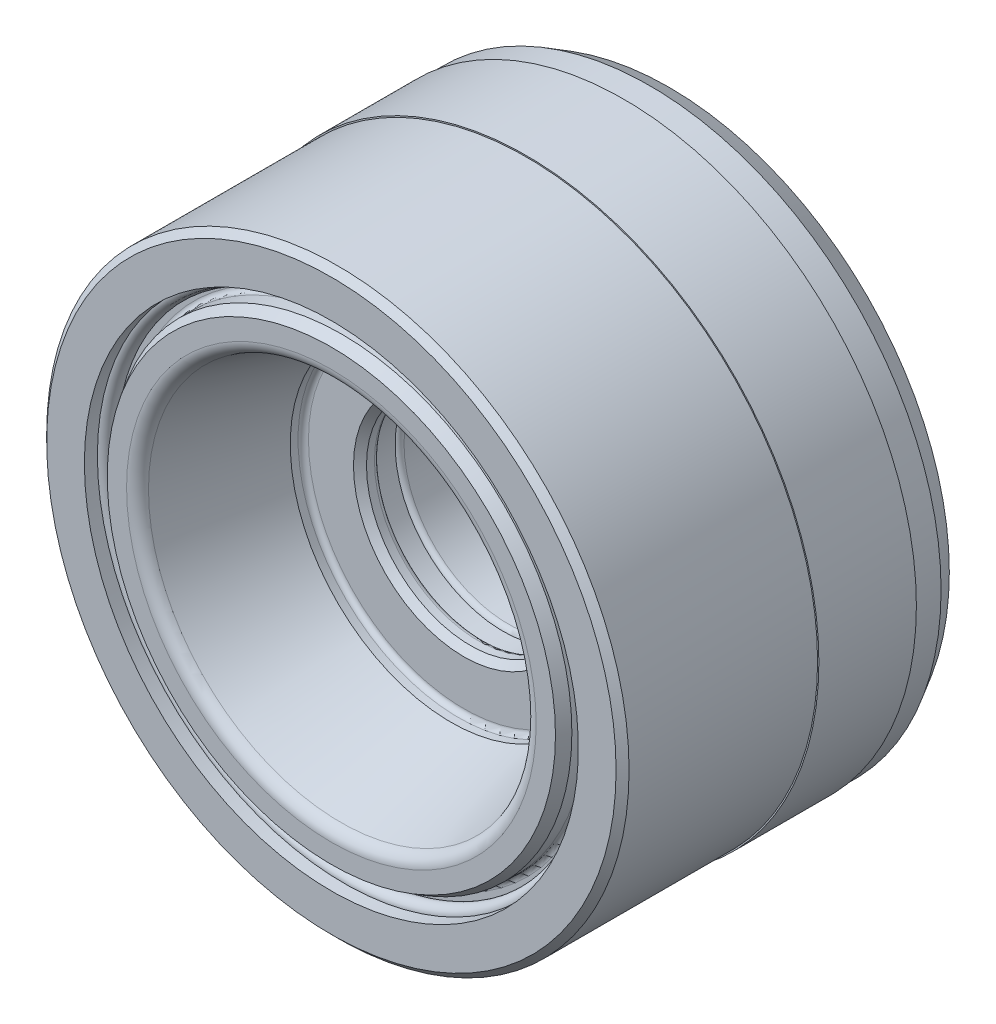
ISO-10303-21;
HEADER;
FILE_DESCRIPTION(('STEP AP214'),'2;1');
FILE_NAME('part.step','',(''),(''),'','','');
FILE_SCHEMA(('AUTOMOTIVE_DESIGN { 1 0 10303 214 1 1 1 1 }'));
ENDSEC;
DATA;
#1=APPLICATION_CONTEXT('core data for automotive mechanical design processes');
#2=APPLICATION_PROTOCOL_DEFINITION('international standard','automotive_design',2000,#1);
#3=PRODUCT_CONTEXT('',#1,'mechanical');
#4=PRODUCT('Part','Part','',(#3));
#5=PRODUCT_RELATED_PRODUCT_CATEGORY('part','',(#4));
#6=PRODUCT_DEFINITION_FORMATION('','',#4);
#7=PRODUCT_DEFINITION_CONTEXT('part definition',#1,'design');
#8=PRODUCT_DEFINITION('design','',#6,#7);
#9=PRODUCT_DEFINITION_SHAPE('','',#8);
#10=(LENGTH_UNIT() NAMED_UNIT(*) SI_UNIT(.MILLI.,.METRE.));
#11=(NAMED_UNIT(*) PLANE_ANGLE_UNIT() SI_UNIT($,.RADIAN.));
#12=(NAMED_UNIT(*) SI_UNIT($,.STERADIAN.) SOLID_ANGLE_UNIT());
#13=UNCERTAINTY_MEASURE_WITH_UNIT(LENGTH_MEASURE(1.E-05),#10,'distance_accuracy_value','');
#14=(GEOMETRIC_REPRESENTATION_CONTEXT(3) GLOBAL_UNCERTAINTY_ASSIGNED_CONTEXT((#13)) GLOBAL_UNIT_ASSIGNED_CONTEXT((#10,
#11,#12)) REPRESENTATION_CONTEXT('',''));
#15=CARTESIAN_POINT('',(0.,0.,0.));
#16=DIRECTION('',(0.,0.,1.));
#17=DIRECTION('',(1.,0.,0.));
#18=AXIS2_PLACEMENT_3D('',#15,#16,#17);
#19=CARTESIAN_POINT('',(0.,0.,0.));
#20=DIRECTION('',(0.,0.,-1.));
#21=DIRECTION('',(-1.,0.,0.));
#22=AXIS2_PLACEMENT_3D('',#19,#20,#21);
#23=CYLINDRICAL_SURFACE('',#22,19.);
#24=CARTESIAN_POINT('',(0.,0.,0.));
#25=DIRECTION('',(0.,0.,-1.));
#26=DIRECTION('',(-1.,0.,0.));
#27=AXIS2_PLACEMENT_3D('',#24,#25,#26);
#28=CIRCLE('',#27,19.);
#29=CARTESIAN_POINT('',(-19.,0.,0.));
#30=VERTEX_POINT('',#29);
#31=EDGE_CURVE('E42',#30,#30,#28,.T.);
#32=ORIENTED_EDGE('',*,*,#31,.F.);
#33=EDGE_LOOP('',(#32));
#34=FACE_BOUND('',#33,.T.);
#35=CARTESIAN_POINT('',(0.,0.,-1.));
#36=DIRECTION('',(0.,0.,-1.));
#37=DIRECTION('',(-1.,0.,0.));
#38=AXIS2_PLACEMENT_3D('',#35,#36,#37);
#39=CIRCLE('',#38,19.);
#40=CARTESIAN_POINT('',(-19.,0.,-1.));
#41=VERTEX_POINT('',#40);
#42=EDGE_CURVE('E81',#41,#41,#39,.F.);
#43=ORIENTED_EDGE('',*,*,#42,.F.);
#44=EDGE_LOOP('',(#43));
#45=FACE_BOUND('',#44,.T.);
#46=ADVANCED_FACE('F12',(#34,#45),#23,.F.);
#47=CARTESIAN_POINT('',(-22.5,0.,0.));
#48=DIRECTION('',(0.,0.,1.));
#49=DIRECTION('',(1.,0.,0.));
#50=AXIS2_PLACEMENT_3D('',#47,#48,#49);
#51=PLANE('',#50);
#52=CARTESIAN_POINT('',(0.,0.,0.));
#53=DIRECTION('',(0.,0.,1.));
#54=DIRECTION('',(1.,0.,0.));
#55=AXIS2_PLACEMENT_3D('',#52,#53,#54);
#56=CIRCLE('',#55,21.9);
#57=CARTESIAN_POINT('',(21.9,0.,0.));
#58=VERTEX_POINT('',#57);
#59=EDGE_CURVE('E54',#58,#58,#56,.T.);
#60=ORIENTED_EDGE('',*,*,#59,.T.);
#61=EDGE_LOOP('',(#60));
#62=FACE_BOUND('',#61,.T.);
#63=ORIENTED_EDGE('',*,*,#31,.T.);
#64=EDGE_LOOP('',(#63));
#65=FACE_BOUND('',#64,.T.);
#66=ADVANCED_FACE('F233',(#62,#65),#51,.T.);
#67=CARTESIAN_POINT('',(0.,0.,-0.499999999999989));
#68=DIRECTION('',(0.,0.,-1.));
#69=DIRECTION('',(-1.,0.,0.));
#70=AXIS2_PLACEMENT_3D('',#67,#68,#69);
#71=CONICAL_SURFACE('',#70,22.4,0.785398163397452);
#72=ORIENTED_EDGE('',*,*,#59,.F.);
#73=EDGE_LOOP('',(#72));
#74=FACE_BOUND('',#73,.T.);
#75=CARTESIAN_POINT('',(0.,0.,-0.499999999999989));
#76=DIRECTION('',(0.,0.,1.));
#77=DIRECTION('',(1.,0.,0.));
#78=AXIS2_PLACEMENT_3D('',#75,#76,#77);
#79=CIRCLE('',#78,22.4);
#80=CARTESIAN_POINT('',(22.4,0.,-0.499999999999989));
#81=VERTEX_POINT('',#80);
#82=EDGE_CURVE('E51',#81,#81,#79,.F.);
#83=ORIENTED_EDGE('',*,*,#82,.F.);
#84=EDGE_LOOP('',(#83));
#85=FACE_BOUND('',#84,.T.);
#86=ADVANCED_FACE('F191',(#74,#85),#71,.T.);
#87=CARTESIAN_POINT('',(0.,0.,0.));
#88=DIRECTION('',(0.,0.,-1.));
#89=DIRECTION('',(-1.,0.,0.));
#90=AXIS2_PLACEMENT_3D('',#87,#88,#89);
#91=CYLINDRICAL_SURFACE('',#90,22.4);
#92=ORIENTED_EDGE('',*,*,#82,.T.);
#93=EDGE_LOOP('',(#92));
#94=FACE_BOUND('',#93,.T.);
#95=CARTESIAN_POINT('',(0.,0.,-15.));
#96=DIRECTION('',(0.,0.,-1.));
#97=DIRECTION('',(-1.,0.,0.));
#98=AXIS2_PLACEMENT_3D('',#95,#96,#97);
#99=CIRCLE('',#98,22.4);
#100=CARTESIAN_POINT('',(-22.4,0.,-15.));
#101=VERTEX_POINT('',#100);
#102=EDGE_CURVE('E29',#101,#101,#99,.T.);
#103=ORIENTED_EDGE('',*,*,#102,.F.);
#104=EDGE_LOOP('',(#103));
#105=FACE_BOUND('',#104,.T.);
#106=ADVANCED_FACE('F186',(#94,#105),#91,.T.);
#107=CARTESIAN_POINT('',(-22.5,0.,-15.));
#108=DIRECTION('',(0.,0.,-1.));
#109=DIRECTION('',(-1.,0.,0.));
#110=AXIS2_PLACEMENT_3D('',#107,#108,#109);
#111=PLANE('',#110);
#112=CARTESIAN_POINT('',(0.,0.,-15.));
#113=DIRECTION('',(0.,0.,-1.));
#114=DIRECTION('',(-1.,0.,0.));
#115=AXIS2_PLACEMENT_3D('',#112,#113,#114);
#116=CIRCLE('',#115,22.5);
#117=CARTESIAN_POINT('',(-22.5,0.,-15.));
#118=VERTEX_POINT('',#117);
#119=EDGE_CURVE('E32',#118,#118,#116,.T.);
#120=ORIENTED_EDGE('',*,*,#119,.F.);
#121=EDGE_LOOP('',(#120));
#122=FACE_BOUND('',#121,.T.);
#123=ORIENTED_EDGE('',*,*,#102,.T.);
#124=EDGE_LOOP('',(#123));
#125=FACE_BOUND('',#124,.T.);
#126=ADVANCED_FACE('F242',(#122,#125),#111,.F.);
#127=CARTESIAN_POINT('',(0.,0.,0.));
#128=DIRECTION('',(0.,0.,-1.));
#129=DIRECTION('',(-1.,0.,0.));
#130=AXIS2_PLACEMENT_3D('',#127,#128,#129);
#131=CYLINDRICAL_SURFACE('',#130,22.5);
#132=ORIENTED_EDGE('',*,*,#119,.T.);
#133=EDGE_LOOP('',(#132));
#134=FACE_BOUND('',#133,.T.);
#135=CARTESIAN_POINT('',(0.,0.,-22.5));
#136=DIRECTION('',(0.,0.,-1.));
#137=DIRECTION('',(-1.,0.,0.));
#138=AXIS2_PLACEMENT_3D('',#135,#136,#137);
#139=CIRCLE('',#138,22.5);
#140=CARTESIAN_POINT('',(-22.5,0.,-22.5));
#141=VERTEX_POINT('',#140);
#142=EDGE_CURVE('E39',#141,#141,#139,.T.);
#143=ORIENTED_EDGE('',*,*,#142,.F.);
#144=EDGE_LOOP('',(#143));
#145=FACE_BOUND('',#144,.T.);
#146=ADVANCED_FACE('F220',(#134,#145),#131,.T.);
#147=CARTESIAN_POINT('',(-22.5,0.,-22.5));
#148=DIRECTION('',(0.,0.,1.));
#149=DIRECTION('',(1.,0.,0.));
#150=AXIS2_PLACEMENT_3D('',#147,#148,#149);
#151=PLANE('',#150);
#152=CARTESIAN_POINT('',(0.,0.,-22.5));
#153=DIRECTION('',(0.,0.,-1.));
#154=DIRECTION('',(-1.,0.,0.));
#155=AXIS2_PLACEMENT_3D('',#152,#153,#154);
#156=CIRCLE('',#155,22.4);
#157=CARTESIAN_POINT('',(-22.4,0.,-22.5));
#158=VERTEX_POINT('',#157);
#159=EDGE_CURVE('E36',#158,#158,#156,.T.);
#160=ORIENTED_EDGE('',*,*,#159,.F.);
#161=EDGE_LOOP('',(#160));
#162=FACE_BOUND('',#161,.T.);
#163=ORIENTED_EDGE('',*,*,#142,.T.);
#164=EDGE_LOOP('',(#163));
#165=FACE_BOUND('',#164,.T.);
#166=ADVANCED_FACE('F241',(#162,#165),#151,.F.);
#167=CARTESIAN_POINT('',(0.,0.,0.));
#168=DIRECTION('',(0.,0.,-1.));
#169=DIRECTION('',(-1.,0.,0.));
#170=AXIS2_PLACEMENT_3D('',#167,#168,#169);
#171=CYLINDRICAL_SURFACE('',#170,22.4);
#172=CARTESIAN_POINT('',(0.,0.,-24.5));
#173=DIRECTION('',(0.,0.,-1.));
#174=DIRECTION('',(-1.,0.,0.));
#175=AXIS2_PLACEMENT_3D('',#172,#173,#174);
#176=CIRCLE('',#175,22.4);
#177=CARTESIAN_POINT('',(-22.4,0.,-24.5));
#178=VERTEX_POINT('',#177);
#179=EDGE_CURVE('E48',#178,#178,#176,.F.);
#180=ORIENTED_EDGE('',*,*,#179,.T.);
#181=EDGE_LOOP('',(#180));
#182=FACE_BOUND('',#181,.T.);
#183=ORIENTED_EDGE('',*,*,#159,.T.);
#184=EDGE_LOOP('',(#183));
#185=FACE_BOUND('',#184,.T.);
#186=ADVANCED_FACE('F187',(#182,#185),#171,.T.);
#187=CARTESIAN_POINT('',(0.,0.,-26.));
#188=DIRECTION('',(0.,0.,1.));
#189=DIRECTION('',(1.,0.,0.));
#190=AXIS2_PLACEMENT_3D('',#187,#188,#189);
#191=CONICAL_SURFACE('',#190,21.5339745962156,0.523598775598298);
#192=ORIENTED_EDGE('',*,*,#179,.F.);
#193=EDGE_LOOP('',(#192));
#194=FACE_BOUND('',#193,.T.);
#195=CARTESIAN_POINT('',(0.,0.,-26.));
#196=DIRECTION('',(0.,0.,-1.));
#197=DIRECTION('',(-1.,0.,0.));
#198=AXIS2_PLACEMENT_3D('',#195,#196,#197);
#199=CIRCLE('',#198,21.5339745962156);
#200=CARTESIAN_POINT('',(-21.5339745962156,0.,-26.));
#201=VERTEX_POINT('',#200);
#202=EDGE_CURVE('E45',#201,#201,#199,.T.);
#203=ORIENTED_EDGE('',*,*,#202,.F.);
#204=EDGE_LOOP('',(#203));
#205=FACE_BOUND('',#204,.T.);
#206=ADVANCED_FACE('F206',(#194,#205),#191,.T.);
#207=CARTESIAN_POINT('',(0.,0.,-18.1));
#208=DIRECTION('',(0.,0.,1.));
#209=DIRECTION('',(1.,0.,0.));
#210=AXIS2_PLACEMENT_3D('',#207,#208,#209);
#211=CONICAL_SURFACE('',#210,10.,0.785398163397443);
#212=CARTESIAN_POINT('',(0.,0.,-18.6));
#213=DIRECTION('',(0.,0.,1.));
#214=DIRECTION('',(1.,0.,0.));
#215=AXIS2_PLACEMENT_3D('',#212,#213,#214);
#216=CIRCLE('',#215,9.5);
#217=CARTESIAN_POINT('',(9.5,0.,-18.6));
#218=VERTEX_POINT('',#217);
#219=EDGE_CURVE('E66',#218,#218,#216,.T.);
#220=ORIENTED_EDGE('',*,*,#219,.F.);
#221=EDGE_LOOP('',(#220));
#222=FACE_BOUND('',#221,.T.);
#223=CARTESIAN_POINT('',(0.,0.,-18.1));
#224=DIRECTION('',(0.,0.,1.));
#225=DIRECTION('',(1.,0.,0.));
#226=AXIS2_PLACEMENT_3D('',#223,#224,#225);
#227=CIRCLE('',#226,10.);
#228=CARTESIAN_POINT('',(10.,0.,-18.1));
#229=VERTEX_POINT('',#228);
#230=EDGE_CURVE('E63',#229,#229,#227,.F.);
#231=ORIENTED_EDGE('',*,*,#230,.F.);
#232=EDGE_LOOP('',(#231));
#233=FACE_BOUND('',#232,.T.);
#234=ADVANCED_FACE('F198',(#222,#233),#211,.F.);
#235=CARTESIAN_POINT('',(0.,0.,-19.6));
#236=DIRECTION('',(0.,0.,1.));
#237=DIRECTION('',(1.,0.,0.));
#238=AXIS2_PLACEMENT_3D('',#235,#236,#237);
#239=CYLINDRICAL_SURFACE('',#238,9.5);
#240=CARTESIAN_POINT('',(0.,0.,-19.2));
#241=DIRECTION('',(0.,0.,-1.));
#242=DIRECTION('',(-1.,0.,0.));
#243=AXIS2_PLACEMENT_3D('',#240,#241,#242);
#244=CIRCLE('',#243,9.5);
#245=CARTESIAN_POINT('',(-9.5,0.,-19.2));
#246=VERTEX_POINT('',#245);
#247=EDGE_CURVE('E69',#246,#246,#244,.T.);
#248=ORIENTED_EDGE('',*,*,#247,.T.);
#249=EDGE_LOOP('',(#248));
#250=FACE_BOUND('',#249,.T.);
#251=ORIENTED_EDGE('',*,*,#219,.T.);
#252=EDGE_LOOP('',(#251));
#253=FACE_BOUND('',#252,.T.);
#254=ADVANCED_FACE('F196',(#250,#253),#239,.F.);
#255=CARTESIAN_POINT('',(0.,0.,-19.2));
#256=DIRECTION('',(0.,0.,-1.));
#257=DIRECTION('',(-1.,0.,0.));
#258=AXIS2_PLACEMENT_3D('',#255,#256,#257);
#259=TOROIDAL_SURFACE('',#258,9.1,0.4);
#260=CARTESIAN_POINT('',(0.,0.,-19.6));
#261=DIRECTION('',(0.,0.,-1.));
#262=DIRECTION('',(-1.,0.,0.));
#263=AXIS2_PLACEMENT_3D('',#260,#261,#262);
#264=CIRCLE('',#263,9.1);
#265=CARTESIAN_POINT('',(-9.1,0.,-19.6));
#266=VERTEX_POINT('',#265);
#267=EDGE_CURVE('E72',#266,#266,#264,.F.);
#268=ORIENTED_EDGE('',*,*,#267,.F.);
#269=EDGE_LOOP('',(#268));
#270=FACE_BOUND('',#269,.T.);
#271=ORIENTED_EDGE('',*,*,#247,.F.);
#272=EDGE_LOOP('',(#271));
#273=FACE_BOUND('',#272,.T.);
#274=ADVANCED_FACE('F177',(#270,#273),#259,.F.);
#275=CARTESIAN_POINT('',(0.,0.,-19.6));
#276=DIRECTION('',(0.,0.,-1.));
#277=DIRECTION('',(-1.,0.,0.));
#278=AXIS2_PLACEMENT_3D('',#275,#276,#277);
#279=PLANE('',#278);
#280=ORIENTED_EDGE('',*,*,#267,.T.);
#281=EDGE_LOOP('',(#280));
#282=FACE_BOUND('',#281,.T.);
#283=CARTESIAN_POINT('',(0.,0.,-19.6));
#284=DIRECTION('',(0.,0.,-1.));
#285=DIRECTION('',(-1.,0.,0.));
#286=AXIS2_PLACEMENT_3D('',#283,#284,#285);
#287=CIRCLE('',#286,7.25);
#288=CARTESIAN_POINT('',(-7.25,0.,-19.6));
#289=VERTEX_POINT('',#288);
#290=EDGE_CURVE('E60',#289,#289,#287,.T.);
#291=ORIENTED_EDGE('',*,*,#290,.T.);
#292=EDGE_LOOP('',(#291));
#293=FACE_BOUND('',#292,.T.);
#294=ADVANCED_FACE('F195',(#282,#293),#279,.F.);
#295=CARTESIAN_POINT('',(0.,0.,-20.6));
#296=DIRECTION('',(0.,0.,1.));
#297=DIRECTION('',(1.,0.,0.));
#298=AXIS2_PLACEMENT_3D('',#295,#296,#297);
#299=CONICAL_SURFACE('',#298,6.25,0.785398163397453);
#300=ORIENTED_EDGE('',*,*,#290,.F.);
#301=EDGE_LOOP('',(#300));
#302=FACE_BOUND('',#301,.T.);
#303=CARTESIAN_POINT('',(0.,0.,-20.6));
#304=DIRECTION('',(0.,0.,-1.));
#305=DIRECTION('',(-1.,0.,0.));
#306=AXIS2_PLACEMENT_3D('',#303,#304,#305);
#307=CIRCLE('',#306,6.25);
#308=CARTESIAN_POINT('',(-6.25,0.,-20.6));
#309=VERTEX_POINT('',#308);
#310=EDGE_CURVE('E57',#309,#309,#307,.F.);
#311=ORIENTED_EDGE('',*,*,#310,.F.);
#312=EDGE_LOOP('',(#311));
#313=FACE_BOUND('',#312,.T.);
#314=ADVANCED_FACE('F188',(#302,#313),#299,.F.);
#315=CARTESIAN_POINT('',(0.,0.,-19.6));
#316=DIRECTION('',(0.,0.,1.));
#317=DIRECTION('',(1.,0.,0.));
#318=AXIS2_PLACEMENT_3D('',#315,#316,#317);
#319=CYLINDRICAL_SURFACE('',#318,6.25);
#320=CARTESIAN_POINT('',(0.,0.,-25.2));
#321=DIRECTION('',(0.,0.,-1.));
#322=DIRECTION('',(-1.,0.,0.));
#323=AXIS2_PLACEMENT_3D('',#320,#321,#322);
#324=CIRCLE('',#323,6.25);
#325=CARTESIAN_POINT('',(-6.25,0.,-25.2));
#326=VERTEX_POINT('',#325);
#327=EDGE_CURVE('E75',#326,#326,#324,.T.);
#328=ORIENTED_EDGE('',*,*,#327,.T.);
#329=EDGE_LOOP('',(#328));
#330=FACE_BOUND('',#329,.T.);
#331=ORIENTED_EDGE('',*,*,#310,.T.);
#332=EDGE_LOOP('',(#331));
#333=FACE_BOUND('',#332,.T.);
#334=ADVANCED_FACE('F175',(#330,#333),#319,.F.);
#335=CARTESIAN_POINT('',(0.,0.,-25.2));
#336=DIRECTION('',(0.,0.,-1.));
#337=DIRECTION('',(-1.,0.,0.));
#338=AXIS2_PLACEMENT_3D('',#335,#336,#337);
#339=CONICAL_SURFACE('',#338,6.25,0.785398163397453);
#340=CARTESIAN_POINT('',(0.,0.,-26.));
#341=DIRECTION('',(0.,0.,-1.));
#342=DIRECTION('',(-1.,0.,0.));
#343=AXIS2_PLACEMENT_3D('',#340,#341,#342);
#344=CIRCLE('',#343,7.05);
#345=CARTESIAN_POINT('',(-7.05,0.,-26.));
#346=VERTEX_POINT('',#345);
#347=EDGE_CURVE('E78',#346,#346,#344,.F.);
#348=ORIENTED_EDGE('',*,*,#347,.F.);
#349=EDGE_LOOP('',(#348));
#350=FACE_BOUND('',#349,.T.);
#351=ORIENTED_EDGE('',*,*,#327,.F.);
#352=EDGE_LOOP('',(#351));
#353=FACE_BOUND('',#352,.T.);
#354=ADVANCED_FACE('F14',(#350,#353),#339,.F.);
#355=CARTESIAN_POINT('',(-22.5,0.,-26.));
#356=DIRECTION('',(0.,0.,-1.));
#357=DIRECTION('',(-1.,0.,0.));
#358=AXIS2_PLACEMENT_3D('',#355,#356,#357);
#359=PLANE('',#358);
#360=ORIENTED_EDGE('',*,*,#347,.T.);
#361=EDGE_LOOP('',(#360));
#362=FACE_BOUND('',#361,.T.);
#363=ORIENTED_EDGE('',*,*,#202,.T.);
#364=EDGE_LOOP('',(#363));
#365=FACE_BOUND('',#364,.T.);
#366=ADVANCED_FACE('F174',(#362,#365),#359,.T.);
#367=CARTESIAN_POINT('',(0.,0.,-1.6));
#368=DIRECTION('',(0.,0.,-1.));
#369=DIRECTION('',(0.,1.,0.));
#370=AXIS2_PLACEMENT_3D('',#367,#368,#369);
#371=TOROIDAL_SURFACE('',#370,19.,0.6);
#372=ORIENTED_EDGE('',*,*,#42,.T.);
#373=EDGE_LOOP('',(#372));
#374=FACE_BOUND('',#373,.T.);
#375=CARTESIAN_POINT('',(0.,0.,-2.2));
#376=DIRECTION('',(0.,0.,1.));
#377=DIRECTION('',(1.,0.,0.));
#378=AXIS2_PLACEMENT_3D('',#375,#376,#377);
#379=CIRCLE('',#378,19.);
#380=CARTESIAN_POINT('',(19.,0.,-2.2));
#381=VERTEX_POINT('',#380);
#382=EDGE_CURVE('E16',#381,#381,#379,.F.);
#383=ORIENTED_EDGE('',*,*,#382,.T.);
#384=EDGE_LOOP('',(#383));
#385=FACE_BOUND('',#384,.T.);
#386=ADVANCED_FACE('F183',(#374,#385),#371,.T.);
#387=CARTESIAN_POINT('',(0.,0.,5.54617539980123));
#388=DIRECTION('',(0.,0.,1.));
#389=DIRECTION('',(1.,0.,0.));
#390=AXIS2_PLACEMENT_3D('',#387,#388,#389);
#391=CYLINDRICAL_SURFACE('',#390,19.);
#392=CARTESIAN_POINT('',(0.,0.,-2.25));
#393=DIRECTION('',(0.,0.,1.));
#394=DIRECTION('',(1.,0.,0.));
#395=AXIS2_PLACEMENT_3D('',#392,#393,#394);
#396=CIRCLE('',#395,19.);
#397=CARTESIAN_POINT('',(19.,0.,-2.25));
#398=VERTEX_POINT('',#397);
#399=EDGE_CURVE('E33',#398,#398,#396,.T.);
#400=ORIENTED_EDGE('',*,*,#399,.F.);
#401=EDGE_LOOP('',(#400));
#402=FACE_BOUND('',#401,.T.);
#403=ORIENTED_EDGE('',*,*,#382,.F.);
#404=EDGE_LOOP('',(#403));
#405=FACE_BOUND('',#404,.T.);
#406=ADVANCED_FACE('F286',(#402,#405),#391,.F.);
#407=CARTESIAN_POINT('',(12.361942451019,0.,-10.2));
#408=DIRECTION('',(0.,0.,1.));
#409=DIRECTION('',(1.,0.,0.));
#410=AXIS2_PLACEMENT_3D('',#407,#408,#409);
#411=PLANE('',#410);
#412=CARTESIAN_POINT('',(0.,0.,-10.2));
#413=DIRECTION('',(0.,0.,1.));
#414=DIRECTION('',(1.,0.,0.));
#415=AXIS2_PLACEMENT_3D('',#412,#413,#414);
#416=CIRCLE('',#415,8.5);
#417=CARTESIAN_POINT('',(8.5,0.,-10.2));
#418=VERTEX_POINT('',#417);
#419=EDGE_CURVE('E113',#418,#418,#416,.F.);
#420=ORIENTED_EDGE('',*,*,#419,.T.);
#421=EDGE_LOOP('',(#420));
#422=FACE_BOUND('',#421,.T.);
#423=CARTESIAN_POINT('',(0.,0.,-10.2));
#424=DIRECTION('',(0.,0.,1.));
#425=DIRECTION('',(1.,0.,0.));
#426=AXIS2_PLACEMENT_3D('',#423,#424,#425);
#427=CIRCLE('',#426,11.961942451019);
#428=CARTESIAN_POINT('',(11.961942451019,0.,-10.2));
#429=VERTEX_POINT('',#428);
#430=EDGE_CURVE('E104',#429,#429,#427,.T.);
#431=ORIENTED_EDGE('',*,*,#430,.T.);
#432=EDGE_LOOP('',(#431));
#433=FACE_BOUND('',#432,.T.);
#434=ADVANCED_FACE('F277',(#422,#433),#411,.T.);
#435=CARTESIAN_POINT('',(0.,0.,-10.7));
#436=DIRECTION('',(0.,0.,1.));
#437=DIRECTION('',(1.,0.,0.));
#438=AXIS2_PLACEMENT_3D('',#435,#436,#437);
#439=CONICAL_SURFACE('',#438,8.,0.78539816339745);
#440=ORIENTED_EDGE('',*,*,#419,.F.);
#441=EDGE_LOOP('',(#440));
#442=FACE_BOUND('',#441,.T.);
#443=CARTESIAN_POINT('',(0.,0.,-10.7));
#444=DIRECTION('',(0.,0.,1.));
#445=DIRECTION('',(1.,0.,0.));
#446=AXIS2_PLACEMENT_3D('',#443,#444,#445);
#447=CIRCLE('',#446,8.);
#448=CARTESIAN_POINT('',(8.,0.,-10.7));
#449=VERTEX_POINT('',#448);
#450=EDGE_CURVE('E110',#449,#449,#447,.T.);
#451=ORIENTED_EDGE('',*,*,#450,.F.);
#452=EDGE_LOOP('',(#451));
#453=FACE_BOUND('',#452,.T.);
#454=ADVANCED_FACE('F275',(#442,#453),#439,.F.);
#455=CARTESIAN_POINT('',(0.,0.,-10.2));
#456=DIRECTION('',(0.,0.,1.));
#457=DIRECTION('',(1.,0.,0.));
#458=AXIS2_PLACEMENT_3D('',#455,#456,#457);
#459=CYLINDRICAL_SURFACE('',#458,8.);
#460=CARTESIAN_POINT('',(0.,0.,-11.3127016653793));
#461=DIRECTION('',(0.,0.,-1.));
#462=DIRECTION('',(-1.,0.,0.));
#463=AXIS2_PLACEMENT_3D('',#460,#461,#462);
#464=CIRCLE('',#463,8.);
#465=CARTESIAN_POINT('',(-8.,0.,-11.3127016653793));
#466=VERTEX_POINT('',#465);
#467=EDGE_CURVE('E119',#466,#466,#464,.T.);
#468=ORIENTED_EDGE('',*,*,#467,.T.);
#469=EDGE_LOOP('',(#468));
#470=FACE_BOUND('',#469,.T.);
#471=ORIENTED_EDGE('',*,*,#450,.T.);
#472=EDGE_LOOP('',(#471));
#473=FACE_BOUND('',#472,.T.);
#474=ADVANCED_FACE('F268',(#470,#473),#459,.F.);
#475=CARTESIAN_POINT('',(0.,0.,-11.3127016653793));
#476=DIRECTION('',(0.,0.,-1.));
#477=DIRECTION('',(-1.,0.,0.));
#478=AXIS2_PLACEMENT_3D('',#475,#476,#477);
#479=TOROIDAL_SURFACE('',#478,8.4,0.4);
#480=ORIENTED_EDGE('',*,*,#467,.F.);
#481=EDGE_LOOP('',(#480));
#482=FACE_BOUND('',#481,.T.);
#483=CARTESIAN_POINT('',(0.,0.,-11.7));
#484=DIRECTION('',(0.,0.,1.));
#485=DIRECTION('',(1.,0.,0.));
#486=AXIS2_PLACEMENT_3D('',#483,#484,#485);
#487=CIRCLE('',#486,8.3);
#488=CARTESIAN_POINT('',(8.3,0.,-11.7));
#489=VERTEX_POINT('',#488);
#490=EDGE_CURVE('E95',#489,#489,#487,.T.);
#491=ORIENTED_EDGE('',*,*,#490,.F.);
#492=EDGE_LOOP('',(#491));
#493=FACE_BOUND('',#492,.T.);
#494=ADVANCED_FACE('F264',(#482,#493),#479,.T.);
#495=CARTESIAN_POINT('',(0.,0.,0.));
#496=DIRECTION('',(0.,0.,1.));
#497=DIRECTION('',(1.,0.,0.));
#498=AXIS2_PLACEMENT_3D('',#495,#496,#497);
#499=CYLINDRICAL_SURFACE('',#498,8.3);
#500=CARTESIAN_POINT('',(0.,0.,-13.2));
#501=DIRECTION('',(0.,0.,1.));
#502=DIRECTION('',(1.,0.,0.));
#503=AXIS2_PLACEMENT_3D('',#500,#501,#502);
#504=CIRCLE('',#503,8.3);
#505=CARTESIAN_POINT('',(8.3,0.,-13.2));
#506=VERTEX_POINT('',#505);
#507=EDGE_CURVE('E80',#506,#506,#504,.T.);
#508=ORIENTED_EDGE('',*,*,#507,.F.);
#509=EDGE_LOOP('',(#508));
#510=FACE_BOUND('',#509,.T.);
#511=ORIENTED_EDGE('',*,*,#490,.T.);
#512=EDGE_LOOP('',(#511));
#513=FACE_BOUND('',#512,.T.);
#514=ADVANCED_FACE('F267',(#510,#513),#499,.F.);
#515=CARTESIAN_POINT('',(0.,0.,-13.5872983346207));
#516=DIRECTION('',(0.,0.,1.));
#517=DIRECTION('',(1.,0.,0.));
#518=AXIS2_PLACEMENT_3D('',#515,#516,#517);
#519=TOROIDAL_SURFACE('',#518,8.4,0.4);
#520=ORIENTED_EDGE('',*,*,#507,.T.);
#521=EDGE_LOOP('',(#520));
#522=FACE_BOUND('',#521,.T.);
#523=CARTESIAN_POINT('',(0.,0.,-13.5872983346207));
#524=DIRECTION('',(0.,0.,1.));
#525=DIRECTION('',(1.,0.,0.));
#526=AXIS2_PLACEMENT_3D('',#523,#524,#525);
#527=CIRCLE('',#526,8.);
#528=CARTESIAN_POINT('',(8.,0.,-13.5872983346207));
#529=VERTEX_POINT('',#528);
#530=EDGE_CURVE('E116',#529,#529,#527,.T.);
#531=ORIENTED_EDGE('',*,*,#530,.F.);
#532=EDGE_LOOP('',(#531));
#533=FACE_BOUND('',#532,.T.);
#534=ADVANCED_FACE('F270',(#522,#533),#519,.T.);
#535=ORIENTED_EDGE('',*,*,#530,.T.);
#536=EDGE_LOOP('',(#535));
#537=FACE_BOUND('',#536,.T.);
#538=CARTESIAN_POINT('',(0.,0.,-18.1));
#539=DIRECTION('',(0.,0.,1.));
#540=DIRECTION('',(1.,0.,0.));
#541=AXIS2_PLACEMENT_3D('',#538,#539,#540);
#542=CIRCLE('',#541,8.);
#543=CARTESIAN_POINT('',(8.,0.,-18.1));
#544=VERTEX_POINT('',#543);
#545=EDGE_CURVE('E98',#544,#544,#542,.T.);
#546=ORIENTED_EDGE('',*,*,#545,.F.);
#547=EDGE_LOOP('',(#546));
#548=FACE_BOUND('',#547,.T.);
#549=ADVANCED_FACE('F273',(#537,#548),#459,.F.);
#550=CARTESIAN_POINT('',(9.05,0.,-18.1));
#551=DIRECTION('',(0.,0.,-1.));
#552=DIRECTION('',(-1.,0.,0.));
#553=AXIS2_PLACEMENT_3D('',#550,#551,#552);
#554=PLANE('',#553);
#555=ORIENTED_EDGE('',*,*,#545,.T.);
#556=EDGE_LOOP('',(#555));
#557=FACE_BOUND('',#556,.T.);
#558=ORIENTED_EDGE('',*,*,#230,.T.);
#559=EDGE_LOOP('',(#558));
#560=FACE_BOUND('',#559,.T.);
#561=ADVANCED_FACE('F169',(#557,#560),#554,.T.);
#562=CARTESIAN_POINT('',(0.,0.,-9.8));
#563=DIRECTION('',(0.,0.,1.));
#564=DIRECTION('',(1.,0.,0.));
#565=AXIS2_PLACEMENT_3D('',#562,#563,#564);
#566=TOROIDAL_SURFACE('',#565,11.961942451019,0.4);
#567=CARTESIAN_POINT('',(0.,0.,-9.8));
#568=DIRECTION('',(0.,0.,1.));
#569=DIRECTION('',(1.,0.,0.));
#570=AXIS2_PLACEMENT_3D('',#567,#568,#569);
#571=CIRCLE('',#570,12.361942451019);
#572=CARTESIAN_POINT('',(12.361942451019,0.,-9.8));
#573=VERTEX_POINT('',#572);
#574=EDGE_CURVE('E107',#573,#573,#571,.F.);
#575=ORIENTED_EDGE('',*,*,#574,.F.);
#576=EDGE_LOOP('',(#575));
#577=FACE_BOUND('',#576,.T.);
#578=ORIENTED_EDGE('',*,*,#430,.F.);
#579=EDGE_LOOP('',(#578));
#580=FACE_BOUND('',#579,.T.);
#581=ADVANCED_FACE('F161',(#577,#580),#566,.F.);
#582=CARTESIAN_POINT('',(0.,0.,0.));
#583=DIRECTION('',(0.,0.,1.));
#584=DIRECTION('',(1.,0.,0.));
#585=AXIS2_PLACEMENT_3D('',#582,#583,#584);
#586=CYLINDRICAL_SURFACE('',#585,12.361942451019);
#587=ORIENTED_EDGE('',*,*,#574,.T.);
#588=EDGE_LOOP('',(#587));
#589=FACE_BOUND('',#588,.T.);
#590=CARTESIAN_POINT('',(0.,0.,-9.2));
#591=DIRECTION('',(0.,0.,1.));
#592=DIRECTION('',(1.,0.,0.));
#593=AXIS2_PLACEMENT_3D('',#590,#591,#592);
#594=CIRCLE('',#593,12.361942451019);
#595=CARTESIAN_POINT('',(12.361942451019,0.,-9.2));
#596=VERTEX_POINT('',#595);
#597=EDGE_CURVE('E101',#596,#596,#594,.T.);
#598=ORIENTED_EDGE('',*,*,#597,.T.);
#599=EDGE_LOOP('',(#598));
#600=FACE_BOUND('',#599,.T.);
#601=ADVANCED_FACE('F156',(#589,#600),#586,.F.);
#602=CARTESIAN_POINT('',(0.,0.,-9.2));
#603=DIRECTION('',(0.,0.,1.));
#604=DIRECTION('',(1.,0.,0.));
#605=AXIS2_PLACEMENT_3D('',#602,#603,#604);
#606=CONICAL_SURFACE('',#605,12.361942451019,0.279252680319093);
#607=CARTESIAN_POINT('',(0.,0.,-0.724362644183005));
#608=DIRECTION('',(0.,0.,-1.));
#609=DIRECTION('',(-1.,0.,0.));
#610=AXIS2_PLACEMENT_3D('',#607,#608,#609);
#611=CIRCLE('',#610,14.7922923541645);
#612=CARTESIAN_POINT('',(-14.7922923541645,0.,-0.724362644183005));
#613=VERTEX_POINT('',#612);
#614=EDGE_CURVE('E122',#613,#613,#611,.F.);
#615=ORIENTED_EDGE('',*,*,#614,.T.);
#616=EDGE_LOOP('',(#615));
#617=FACE_BOUND('',#616,.T.);
#618=ORIENTED_EDGE('',*,*,#597,.F.);
#619=EDGE_LOOP('',(#618));
#620=FACE_BOUND('',#619,.T.);
#621=ADVANCED_FACE('F150',(#617,#620),#606,.F.);
#622=CARTESIAN_POINT('',(0.,0.,-1.));
#623=DIRECTION('',(0.,0.,1.));
#624=DIRECTION('',(1.,0.,0.));
#625=AXIS2_PLACEMENT_3D('',#622,#623,#624);
#626=TOROIDAL_SURFACE('',#625,15.7535540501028,1.);
#627=CARTESIAN_POINT('',(0.,0.,0.));
#628=DIRECTION('',(0.,0.,1.));
#629=DIRECTION('',(1.,0.,0.));
#630=AXIS2_PLACEMENT_3D('',#627,#628,#629);
#631=CIRCLE('',#630,15.7535540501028);
#632=CARTESIAN_POINT('',(15.7535540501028,0.,0.));
#633=VERTEX_POINT('',#632);
#634=EDGE_CURVE('E125',#633,#633,#631,.F.);
#635=ORIENTED_EDGE('',*,*,#634,.F.);
#636=EDGE_LOOP('',(#635));
#637=FACE_BOUND('',#636,.T.);
#638=ORIENTED_EDGE('',*,*,#614,.F.);
#639=EDGE_LOOP('',(#638));
#640=FACE_BOUND('',#639,.T.);
#641=ADVANCED_FACE('F144',(#637,#640),#626,.T.);
#642=CARTESIAN_POINT('',(19.,0.,0.));
#643=DIRECTION('',(0.,0.,1.));
#644=DIRECTION('',(1.,0.,0.));
#645=AXIS2_PLACEMENT_3D('',#642,#643,#644);
#646=PLANE('',#645);
#647=CARTESIAN_POINT('',(0.,0.,0.));
#648=DIRECTION('',(0.,0.,1.));
#649=DIRECTION('',(1.,0.,0.));
#650=AXIS2_PLACEMENT_3D('',#647,#648,#649);
#651=CIRCLE('',#650,17.2381197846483);
#652=CARTESIAN_POINT('',(17.2381197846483,0.,0.));
#653=VERTEX_POINT('',#652);
#654=EDGE_CURVE('E128',#653,#653,#651,.T.);
#655=ORIENTED_EDGE('',*,*,#654,.T.);
#656=EDGE_LOOP('',(#655));
#657=FACE_BOUND('',#656,.T.);
#658=ORIENTED_EDGE('',*,*,#634,.T.);
#659=EDGE_LOOP('',(#658));
#660=FACE_BOUND('',#659,.T.);
#661=ADVANCED_FACE('F138',(#657,#660),#646,.T.);
#662=CARTESIAN_POINT('',(0.,0.,0.));
#663=DIRECTION('',(0.,0.,-1.));
#664=DIRECTION('',(-1.,0.,0.));
#665=AXIS2_PLACEMENT_3D('',#662,#663,#664);
#666=CONICAL_SURFACE('',#665,17.2381197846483,0.523598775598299);
#667=CARTESIAN_POINT('',(0.,0.,-0.8));
#668=DIRECTION('',(0.,0.,1.));
#669=DIRECTION('',(1.,0.,0.));
#670=AXIS2_PLACEMENT_3D('',#667,#668,#669);
#671=CIRCLE('',#670,17.7);
#672=CARTESIAN_POINT('',(17.7,0.,-0.8));
#673=VERTEX_POINT('',#672);
#674=EDGE_CURVE('E25',#673,#673,#671,.F.);
#675=ORIENTED_EDGE('',*,*,#674,.F.);
#676=EDGE_LOOP('',(#675));
#677=FACE_BOUND('',#676,.T.);
#678=ORIENTED_EDGE('',*,*,#654,.F.);
#679=EDGE_LOOP('',(#678));
#680=FACE_BOUND('',#679,.T.);
#681=ADVANCED_FACE('F135',(#677,#680),#666,.T.);
#682=CARTESIAN_POINT('',(0.,0.,0.));
#683=DIRECTION('',(0.,0.,1.));
#684=DIRECTION('',(1.,0.,0.));
#685=AXIS2_PLACEMENT_3D('',#682,#683,#684);
#686=CYLINDRICAL_SURFACE('',#685,17.7);
#687=CARTESIAN_POINT('',(0.,0.,-1.85));
#688=DIRECTION('',(0.,0.,1.));
#689=DIRECTION('',(1.,0.,0.));
#690=AXIS2_PLACEMENT_3D('',#687,#688,#689);
#691=CIRCLE('',#690,17.7);
#692=CARTESIAN_POINT('',(17.7,0.,-1.85));
#693=VERTEX_POINT('',#692);
#694=EDGE_CURVE('E20',#693,#693,#691,.T.);
#695=ORIENTED_EDGE('',*,*,#694,.T.);
#696=EDGE_LOOP('',(#695));
#697=FACE_BOUND('',#696,.T.);
#698=ORIENTED_EDGE('',*,*,#674,.T.);
#699=EDGE_LOOP('',(#698));
#700=FACE_BOUND('',#699,.T.);
#701=ADVANCED_FACE('F133',(#697,#700),#686,.T.);
#702=CARTESIAN_POINT('',(0.,0.,-1.85));
#703=DIRECTION('',(0.,0.,1.));
#704=DIRECTION('',(1.,0.,0.));
#705=AXIS2_PLACEMENT_3D('',#702,#703,#704);
#706=TOROIDAL_SURFACE('',#705,18.1,0.4);
#707=CARTESIAN_POINT('',(0.,0.,-2.25));
#708=DIRECTION('',(0.,0.,1.));
#709=DIRECTION('',(1.,0.,0.));
#710=AXIS2_PLACEMENT_3D('',#707,#708,#709);
#711=CIRCLE('',#710,18.1);
#712=CARTESIAN_POINT('',(18.1,0.,-2.25));
#713=VERTEX_POINT('',#712);
#714=EDGE_CURVE('E8',#713,#713,#711,.F.);
#715=ORIENTED_EDGE('',*,*,#714,.F.);
#716=EDGE_LOOP('',(#715));
#717=FACE_BOUND('',#716,.T.);
#718=ORIENTED_EDGE('',*,*,#694,.F.);
#719=EDGE_LOOP('',(#718));
#720=FACE_BOUND('',#719,.T.);
#721=ADVANCED_FACE('F259',(#717,#720),#706,.F.);
#722=CARTESIAN_POINT('',(-17.7,0.,-2.25));
#723=DIRECTION('',(0.,0.,1.));
#724=DIRECTION('',(1.,0.,0.));
#725=AXIS2_PLACEMENT_3D('',#722,#723,#724);
#726=PLANE('',#725);
#727=ORIENTED_EDGE('',*,*,#714,.T.);
#728=EDGE_LOOP('',(#727));
#729=FACE_BOUND('',#728,.T.);
#730=ORIENTED_EDGE('',*,*,#399,.T.);
#731=EDGE_LOOP('',(#730));
#732=FACE_BOUND('',#731,.T.);
#733=ADVANCED_FACE('F261',(#729,#732),#726,.T.);
#734=CLOSED_SHELL('',(#46,#66,#86,#106,#126,#146,#166,#186,#206,#234,#254,#274,#294,#314,#334,
#354,#366,#386,#406,#434,#454,#474,#494,#514,#534,#549,#561,#581,#601,#621,#641,#661,#681,#701,
#721,#733));
#735=MANIFOLD_SOLID_BREP('B1',#734);
#736=ADVANCED_BREP_SHAPE_REPRESENTATION('',(#18,#735),#14);
#737=SHAPE_DEFINITION_REPRESENTATION(#9,#736);
ENDSEC;
END-ISO-10303-21;
